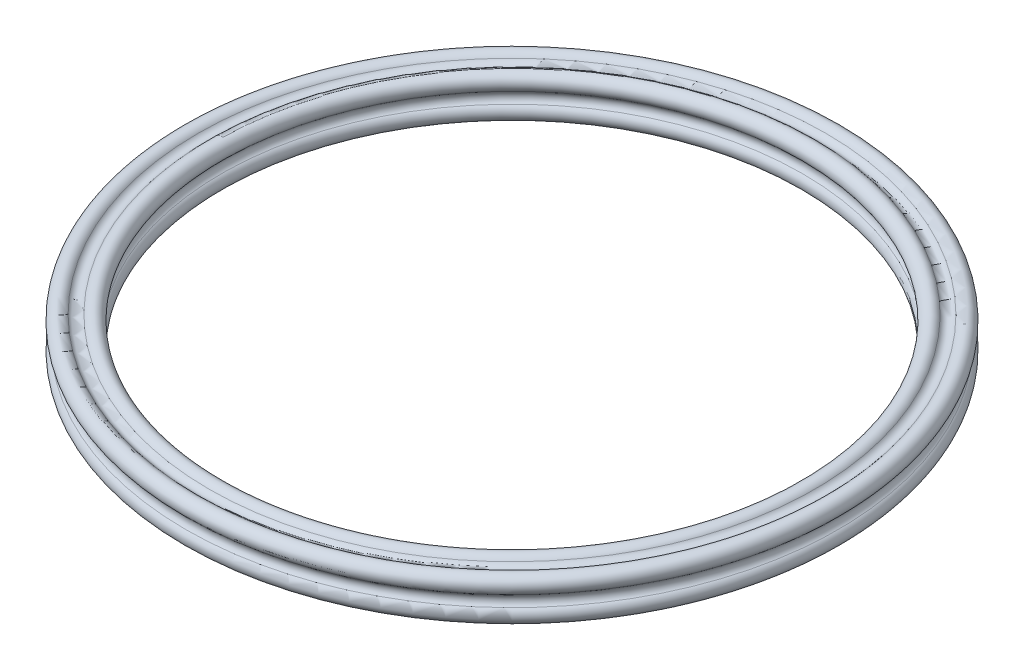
from build123d import *


with BuildPart() as part:
    # Esquisse1 → R_volution1 (revolve)
    with BuildSketch(Plane.XY, mode=Mode.PRIVATE) as r_volution1_sk:
        with BuildLine():
            ThreePointArc((-36.194444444, 4.49252025), (-37.707106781, 4.607106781), (-37.59252025, 3.094444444))
            ThreePointArc((-37.59252025, 3.094444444), (-37.26653645, 2.45), (-37.59252025, 1.805555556))
            ThreePointArc((-37.59252025, 1.805555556), (-37.707106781, 0.292893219), (-36.194444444, 0.40747975))
            ThreePointArc((-36.194444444, 0.40747975), (-35.55, 0.73346355), (-34.905555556, 0.40747975))
            ThreePointArc((-34.905555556, 0.40747975), (-33.392893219, 0.292893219), (-33.50747975, 1.805555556))
            ThreePointArc((-33.50747975, 1.805555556), (-33.83346355, 2.45), (-33.50747975, 3.094444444))
            ThreePointArc((-33.50747975, 3.094444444), (-33.392893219, 4.607106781), (-34.905555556, 4.49252025))
            ThreePointArc((-34.905555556, 4.49252025), (-35.55, 4.16653645), (-36.194444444, 4.49252025))
        make_face()
    revolve(r_volution1_sk.sketch.rotate(Axis((0, 0, 0), (0, 1, 0)), 270), axis=Axis((0, 0, 0), (0, 1, 0)))


solid = part.part
